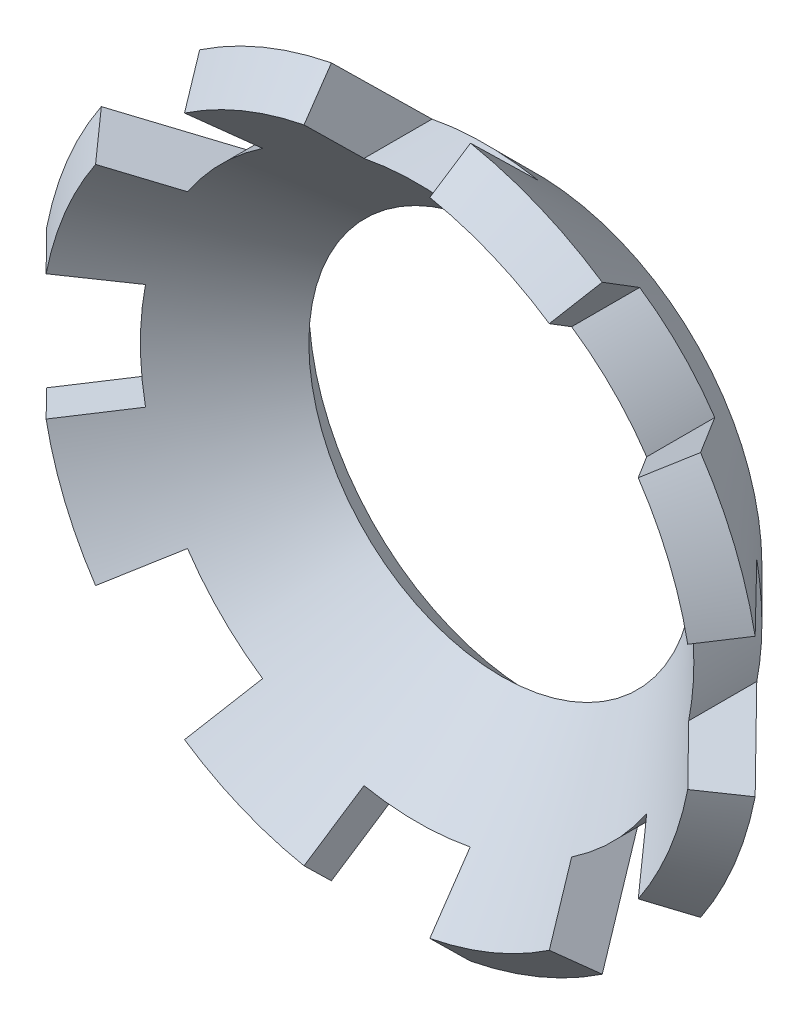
from build123d import *

# Parameters (mm, degrees)
TOOTHCUT_DEPTH = 5.387258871
TOOTHPAT_COUNT = 8


with BuildPart() as part:
    # BodySke → BaseBody (revolve)
    with BuildSketch(Plane(origin=(0, 0, 0), x_dir=(1, 0, 0), z_dir=(0, 1, 0))):
        Polygon((3, 0), (1.882842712, 1.117157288), (1.6, 0.834314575), (2.717157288, -0.282842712), align=None)
    revolve(axis=Axis((0, 0, 1.599979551), (0, 0, -1)))

    # ToothSke → ToothCut (cut, symmetric)
    with BuildSketch(Plane.XY):
        with BuildLine():
            Line((2.257265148, 0.441309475), (3, 0.589048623))
            Line((3, 0.589048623), (3, -0.589048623))
            Line((3, -0.589048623), (2.257265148, -0.441309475))
            ThreePointArc((2.257265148, -0.441309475), (2.3, 0), (2.257265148, 0.441309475))
        make_face()
    toothcut = extrude(amount=TOOTHCUT_DEPTH, both=True, mode=Mode.SUBTRACT)

    # ToothPat: ToothCut ×8 about axis
    toothpat_axis = Axis((0, 0, 0), (0, 0, 1))
    for i in range(1, TOOTHPAT_COUNT):
        add(toothcut.rotate(toothpat_axis, i * 360 / TOOTHPAT_COUNT), mode=Mode.SUBTRACT)


solid = part.part
